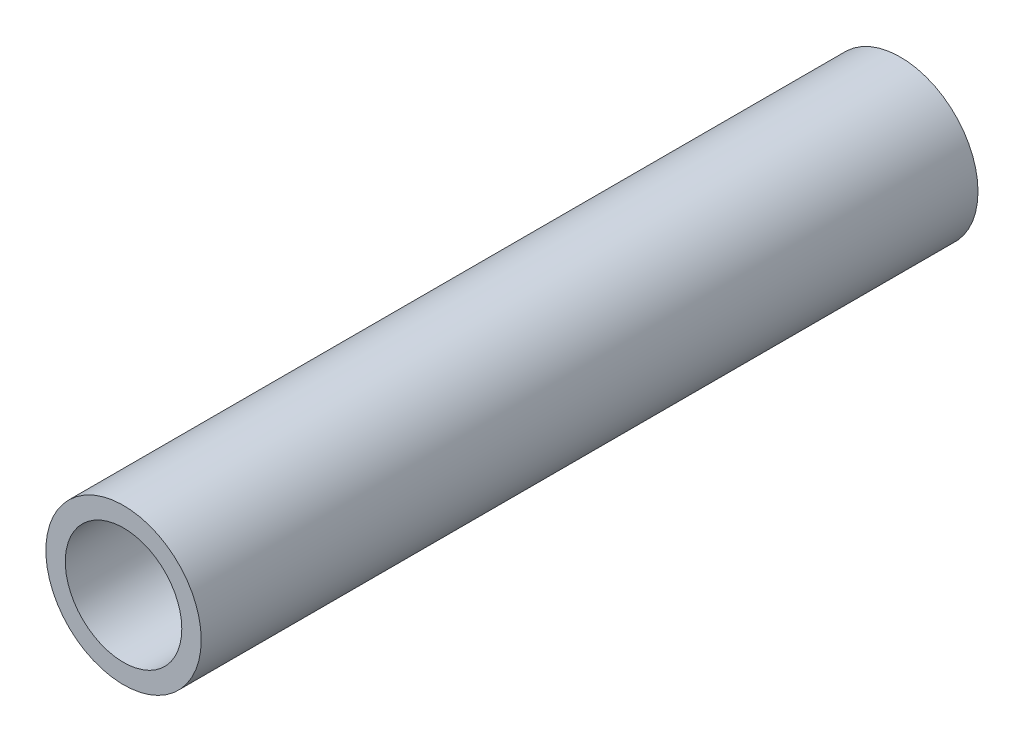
ISO-10303-21;
HEADER;
FILE_DESCRIPTION(('STEP AP214'),'2;1');
FILE_NAME('part.step','',(''),(''),'','','');
FILE_SCHEMA(('AUTOMOTIVE_DESIGN { 1 0 10303 214 1 1 1 1 }'));
ENDSEC;
DATA;
#1=APPLICATION_CONTEXT('core data for automotive mechanical design processes');
#2=APPLICATION_PROTOCOL_DEFINITION('international standard','automotive_design',2000,#1);
#3=PRODUCT_CONTEXT('',#1,'mechanical');
#4=PRODUCT('Part','Part','',(#3));
#5=PRODUCT_RELATED_PRODUCT_CATEGORY('part','',(#4));
#6=PRODUCT_DEFINITION_FORMATION('','',#4);
#7=PRODUCT_DEFINITION_CONTEXT('part definition',#1,'design');
#8=PRODUCT_DEFINITION('design','',#6,#7);
#9=PRODUCT_DEFINITION_SHAPE('','',#8);
#10=(LENGTH_UNIT() NAMED_UNIT(*) SI_UNIT(.MILLI.,.METRE.));
#11=(NAMED_UNIT(*) PLANE_ANGLE_UNIT() SI_UNIT($,.RADIAN.));
#12=(NAMED_UNIT(*) SI_UNIT($,.STERADIAN.) SOLID_ANGLE_UNIT());
#13=UNCERTAINTY_MEASURE_WITH_UNIT(LENGTH_MEASURE(1.E-05),#10,'distance_accuracy_value','');
#14=(GEOMETRIC_REPRESENTATION_CONTEXT(3) GLOBAL_UNCERTAINTY_ASSIGNED_CONTEXT((#13)) GLOBAL_UNIT_ASSIGNED_CONTEXT((#10,
#11,#12)) REPRESENTATION_CONTEXT('',''));
#15=CARTESIAN_POINT('',(0.,0.,0.));
#16=DIRECTION('',(0.,0.,1.));
#17=DIRECTION('',(1.,0.,0.));
#18=AXIS2_PLACEMENT_3D('',#15,#16,#17);
#19=CARTESIAN_POINT('',(0.,0.,20.));
#20=DIRECTION('',(0.,0.,-1.));
#21=DIRECTION('',(-1.,0.,0.));
#22=AXIS2_PLACEMENT_3D('',#19,#20,#21);
#23=CYLINDRICAL_SURFACE('',#22,2.);
#24=CARTESIAN_POINT('',(0.,0.,20.));
#25=DIRECTION('',(0.,0.,1.));
#26=DIRECTION('',(1.,0.,0.));
#27=AXIS2_PLACEMENT_3D('',#24,#25,#26);
#28=CIRCLE('',#27,2.);
#29=CARTESIAN_POINT('',(2.,0.,20.));
#30=VERTEX_POINT('',#29);
#31=EDGE_CURVE('E10',#30,#30,#28,.T.);
#32=ORIENTED_EDGE('',*,*,#31,.F.);
#33=EDGE_LOOP('',(#32));
#34=FACE_BOUND('',#33,.T.);
#35=CARTESIAN_POINT('',(0.,0.,0.));
#36=DIRECTION('',(0.,0.,1.));
#37=DIRECTION('',(1.,0.,0.));
#38=AXIS2_PLACEMENT_3D('',#35,#36,#37);
#39=CIRCLE('',#38,2.);
#40=CARTESIAN_POINT('',(2.,0.,0.));
#41=VERTEX_POINT('',#40);
#42=EDGE_CURVE('E35',#41,#41,#39,.T.);
#43=ORIENTED_EDGE('',*,*,#42,.T.);
#44=EDGE_LOOP('',(#43));
#45=FACE_BOUND('',#44,.T.);
#46=ADVANCED_FACE('F32',(#34,#45),#23,.T.);
#47=CARTESIAN_POINT('',(0.,0.,20.));
#48=DIRECTION('',(0.,0.,1.));
#49=DIRECTION('',(1.,0.,0.));
#50=AXIS2_PLACEMENT_3D('',#47,#48,#49);
#51=PLANE('',#50);
#52=CARTESIAN_POINT('',(0.,0.,20.));
#53=DIRECTION('',(0.,0.,1.));
#54=DIRECTION('',(1.,0.,0.));
#55=AXIS2_PLACEMENT_3D('',#52,#53,#54);
#56=CIRCLE('',#55,1.49999999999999);
#57=CARTESIAN_POINT('',(1.49999999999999,0.,20.));
#58=VERTEX_POINT('',#57);
#59=EDGE_CURVE('E46',#58,#58,#56,.T.);
#60=ORIENTED_EDGE('',*,*,#59,.F.);
#61=EDGE_LOOP('',(#60));
#62=FACE_BOUND('',#61,.T.);
#63=ORIENTED_EDGE('',*,*,#31,.T.);
#64=EDGE_LOOP('',(#63));
#65=FACE_BOUND('',#64,.T.);
#66=ADVANCED_FACE('F52',(#62,#65),#51,.T.);
#67=CARTESIAN_POINT('',(0.,0.,0.));
#68=DIRECTION('',(0.,0.,1.));
#69=DIRECTION('',(1.,0.,0.));
#70=AXIS2_PLACEMENT_3D('',#67,#68,#69);
#71=PLANE('',#70);
#72=CARTESIAN_POINT('',(0.,0.,0.));
#73=DIRECTION('',(0.,0.,1.));
#74=DIRECTION('',(1.,0.,0.));
#75=AXIS2_PLACEMENT_3D('',#72,#73,#74);
#76=CIRCLE('',#75,1.49999999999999);
#77=CARTESIAN_POINT('',(1.49999999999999,0.,0.));
#78=VERTEX_POINT('',#77);
#79=EDGE_CURVE('E42',#78,#78,#76,.T.);
#80=ORIENTED_EDGE('',*,*,#79,.T.);
#81=EDGE_LOOP('',(#80));
#82=FACE_BOUND('',#81,.T.);
#83=ORIENTED_EDGE('',*,*,#42,.F.);
#84=EDGE_LOOP('',(#83));
#85=FACE_BOUND('',#84,.T.);
#86=ADVANCED_FACE('F54',(#82,#85),#71,.F.);
#87=CARTESIAN_POINT('',(0.,0.,20.));
#88=DIRECTION('',(0.,0.,1.));
#89=DIRECTION('',(1.,0.,0.));
#90=AXIS2_PLACEMENT_3D('',#87,#88,#89);
#91=CYLINDRICAL_SURFACE('',#90,1.49999999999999);
#92=ORIENTED_EDGE('',*,*,#79,.F.);
#93=EDGE_LOOP('',(#92));
#94=FACE_BOUND('',#93,.T.);
#95=ORIENTED_EDGE('',*,*,#59,.T.);
#96=EDGE_LOOP('',(#95));
#97=FACE_BOUND('',#96,.T.);
#98=ADVANCED_FACE('F50',(#94,#97),#91,.F.);
#99=CLOSED_SHELL('',(#46,#66,#86,#98));
#100=MANIFOLD_SOLID_BREP('B2',#99);
#101=ADVANCED_BREP_SHAPE_REPRESENTATION('',(#18,#100),#14);
#102=SHAPE_DEFINITION_REPRESENTATION(#9,#101);
ENDSEC;
END-ISO-10303-21;
